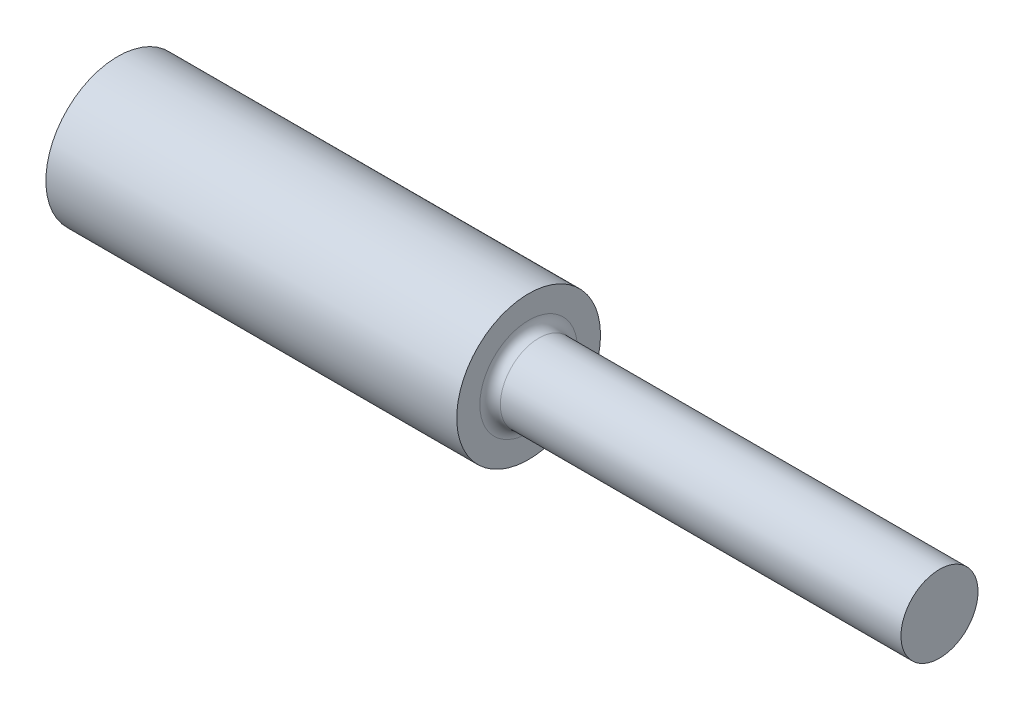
from build123d import *

# Parameters (mm, degrees)
FILLET2_R = 2.54


with BuildPart() as part:
    # Sketch3 → Revolve1 (revolve)
    with BuildSketch(Plane(origin=(0, 0, 0), x_dir=(-1, 0, 0), z_dir=(0, 0, -1)), mode=Mode.PRIVATE) as revolve1_sk:
        Polygon((-101.6, 0), (-101.6, 9.525), (0, 9.525), (0, 17.78), (101.6, 17.78), (101.6, 0), align=None)
    revolve(revolve1_sk.sketch.rotate(Axis((60.410810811, 0, 0), (-1, 0, 0)), 90), axis=Axis((60.410810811, 0, 0), (-1, 0, 0)))

    # Fillet2
    fillet2_edges = [part.edges().sort_by_distance(p)[0] for p in [
        (0, 0, 9.525),
    ]]
    fillet(fillet2_edges, radius=FILLET2_R)


solid = part.part
